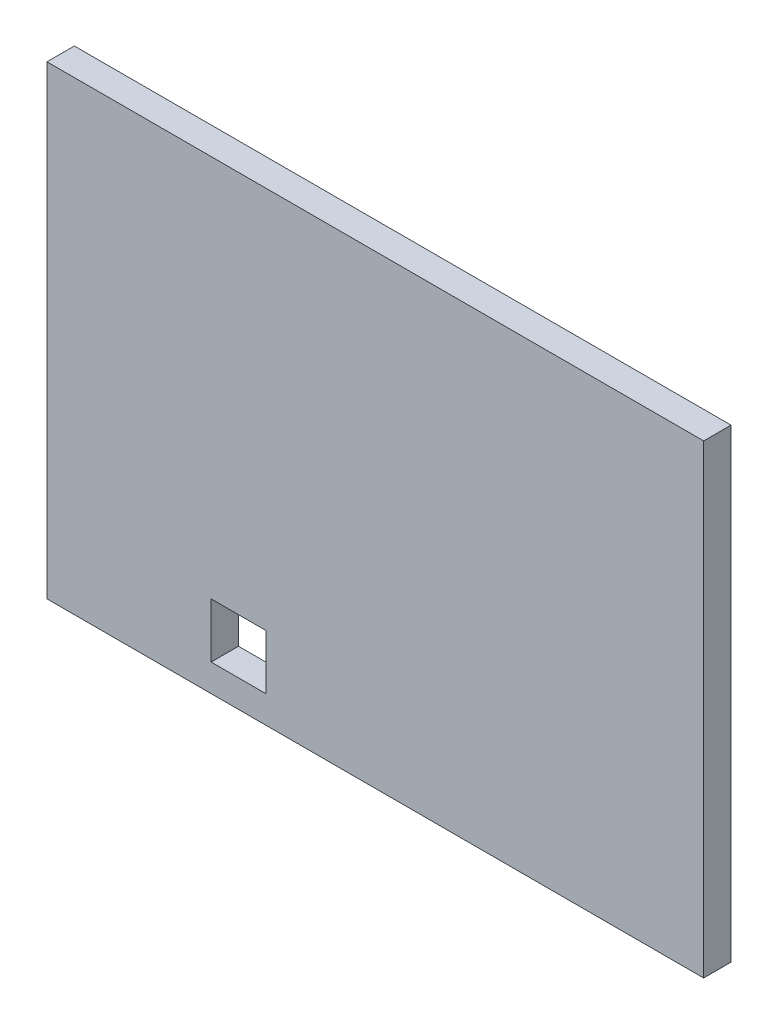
ISO-10303-21;
HEADER;
FILE_DESCRIPTION(('STEP AP214'),'2;1');
FILE_NAME('part.step','',(''),(''),'','','');
FILE_SCHEMA(('AUTOMOTIVE_DESIGN { 1 0 10303 214 1 1 1 1 }'));
ENDSEC;
DATA;
#1=APPLICATION_CONTEXT('core data for automotive mechanical design processes');
#2=APPLICATION_PROTOCOL_DEFINITION('international standard','automotive_design',2000,#1);
#3=PRODUCT_CONTEXT('',#1,'mechanical');
#4=PRODUCT('Part','Part','',(#3));
#5=PRODUCT_RELATED_PRODUCT_CATEGORY('part','',(#4));
#6=PRODUCT_DEFINITION_FORMATION('','',#4);
#7=PRODUCT_DEFINITION_CONTEXT('part definition',#1,'design');
#8=PRODUCT_DEFINITION('design','',#6,#7);
#9=PRODUCT_DEFINITION_SHAPE('','',#8);
#10=(LENGTH_UNIT() NAMED_UNIT(*) SI_UNIT(.MILLI.,.METRE.));
#11=(NAMED_UNIT(*) PLANE_ANGLE_UNIT() SI_UNIT($,.RADIAN.));
#12=(NAMED_UNIT(*) SI_UNIT($,.STERADIAN.) SOLID_ANGLE_UNIT());
#13=UNCERTAINTY_MEASURE_WITH_UNIT(LENGTH_MEASURE(1.E-05),#10,'distance_accuracy_value','');
#14=(GEOMETRIC_REPRESENTATION_CONTEXT(3) GLOBAL_UNCERTAINTY_ASSIGNED_CONTEXT((#13)) GLOBAL_UNIT_ASSIGNED_CONTEXT((#10,
#11,#12)) REPRESENTATION_CONTEXT('',''));
#15=CARTESIAN_POINT('',(0.,0.,0.));
#16=DIRECTION('',(0.,0.,1.));
#17=DIRECTION('',(1.,0.,0.));
#18=AXIS2_PLACEMENT_3D('',#15,#16,#17);
#19=CARTESIAN_POINT('',(-60.,-42.5,5.));
#20=DIRECTION('',(1.,0.,0.));
#21=DIRECTION('',(0.,0.,-1.));
#22=AXIS2_PLACEMENT_3D('',#19,#20,#21);
#23=PLANE('',#22);
#24=DIRECTION('',(0.,-1.,0.));
#25=VECTOR('',#24,1.);
#26=CARTESIAN_POINT('',(-60.,-42.5,0.));
#27=LINE('',#26,#25);
#28=CARTESIAN_POINT('',(-60.,42.5,0.));
#29=VERTEX_POINT('',#28);
#30=CARTESIAN_POINT('',(-60.,-42.5,0.));
#31=VERTEX_POINT('',#30);
#32=EDGE_CURVE('E137',#29,#31,#27,.T.);
#33=ORIENTED_EDGE('',*,*,#32,.T.);
#34=DIRECTION('',(0.,0.,-1.));
#35=VECTOR('',#34,1.);
#36=CARTESIAN_POINT('',(-60.,-42.5,5.));
#37=LINE('',#36,#35);
#38=CARTESIAN_POINT('',(-60.,-42.5,5.));
#39=VERTEX_POINT('',#38);
#40=EDGE_CURVE('E166',#39,#31,#37,.T.);
#41=ORIENTED_EDGE('',*,*,#40,.F.);
#42=DIRECTION('',(0.,-1.,0.));
#43=VECTOR('',#42,1.);
#44=CARTESIAN_POINT('',(-60.,-42.5,5.));
#45=LINE('',#44,#43);
#46=CARTESIAN_POINT('',(-60.,42.5,5.));
#47=VERTEX_POINT('',#46);
#48=EDGE_CURVE('E140',#47,#39,#45,.T.);
#49=ORIENTED_EDGE('',*,*,#48,.F.);
#50=DIRECTION('',(0.,0.,-1.));
#51=VECTOR('',#50,1.);
#52=CARTESIAN_POINT('',(-60.,42.5,5.));
#53=LINE('',#52,#51);
#54=EDGE_CURVE('E150',#47,#29,#53,.T.);
#55=ORIENTED_EDGE('',*,*,#54,.T.);
#56=EDGE_LOOP('',(#33,#41,#49,#55));
#57=FACE_BOUND('',#56,.T.);
#58=ADVANCED_FACE('F47',(#57),#23,.F.);
#59=CARTESIAN_POINT('',(60.,-42.5,5.));
#60=DIRECTION('',(0.,1.,0.));
#61=DIRECTION('',(-1.,0.,0.));
#62=AXIS2_PLACEMENT_3D('',#59,#60,#61);
#63=PLANE('',#62);
#64=DIRECTION('',(1.,0.,0.));
#65=VECTOR('',#64,1.);
#66=CARTESIAN_POINT('',(60.,-42.5,0.));
#67=LINE('',#66,#65);
#68=CARTESIAN_POINT('',(60.,-42.5,0.));
#69=VERTEX_POINT('',#68);
#70=EDGE_CURVE('E153',#31,#69,#67,.T.);
#71=ORIENTED_EDGE('',*,*,#70,.T.);
#72=DIRECTION('',(0.,0.,-1.));
#73=VECTOR('',#72,1.);
#74=CARTESIAN_POINT('',(60.,-42.5,5.));
#75=LINE('',#74,#73);
#76=CARTESIAN_POINT('',(60.,-42.5,5.));
#77=VERTEX_POINT('',#76);
#78=EDGE_CURVE('E163',#77,#69,#75,.T.);
#79=ORIENTED_EDGE('',*,*,#78,.F.);
#80=DIRECTION('',(1.,0.,0.));
#81=VECTOR('',#80,1.);
#82=CARTESIAN_POINT('',(60.,-42.5,5.));
#83=LINE('',#82,#81);
#84=EDGE_CURVE('E143',#39,#77,#83,.T.);
#85=ORIENTED_EDGE('',*,*,#84,.F.);
#86=ORIENTED_EDGE('',*,*,#40,.T.);
#87=EDGE_LOOP('',(#71,#79,#85,#86));
#88=FACE_BOUND('',#87,.T.);
#89=ADVANCED_FACE('F191',(#88),#63,.F.);
#90=CARTESIAN_POINT('',(60.,-42.5,5.));
#91=DIRECTION('',(-1.,0.,0.));
#92=DIRECTION('',(0.,0.,1.));
#93=AXIS2_PLACEMENT_3D('',#90,#91,#92);
#94=PLANE('',#93);
#95=DIRECTION('',(0.,1.,0.));
#96=VECTOR('',#95,1.);
#97=CARTESIAN_POINT('',(60.,-42.5,0.));
#98=LINE('',#97,#96);
#99=CARTESIAN_POINT('',(60.,42.5,0.));
#100=VERTEX_POINT('',#99);
#101=EDGE_CURVE('E155',#69,#100,#98,.T.);
#102=ORIENTED_EDGE('',*,*,#101,.T.);
#103=DIRECTION('',(0.,0.,-1.));
#104=VECTOR('',#103,1.);
#105=CARTESIAN_POINT('',(60.,42.5,5.));
#106=LINE('',#105,#104);
#107=CARTESIAN_POINT('',(60.,42.5,5.));
#108=VERTEX_POINT('',#107);
#109=EDGE_CURVE('E160',#108,#100,#106,.T.);
#110=ORIENTED_EDGE('',*,*,#109,.F.);
#111=DIRECTION('',(0.,1.,0.));
#112=VECTOR('',#111,1.);
#113=CARTESIAN_POINT('',(60.,-42.5,5.));
#114=LINE('',#113,#112);
#115=EDGE_CURVE('E146',#77,#108,#114,.T.);
#116=ORIENTED_EDGE('',*,*,#115,.F.);
#117=ORIENTED_EDGE('',*,*,#78,.T.);
#118=EDGE_LOOP('',(#102,#110,#116,#117));
#119=FACE_BOUND('',#118,.T.);
#120=ADVANCED_FACE('F196',(#119),#94,.F.);
#121=CARTESIAN_POINT('',(60.,42.5,5.));
#122=DIRECTION('',(0.,-1.,0.));
#123=DIRECTION('',(1.,0.,0.));
#124=AXIS2_PLACEMENT_3D('',#121,#122,#123);
#125=PLANE('',#124);
#126=DIRECTION('',(-1.,0.,0.));
#127=VECTOR('',#126,1.);
#128=CARTESIAN_POINT('',(60.,42.5,0.));
#129=LINE('',#128,#127);
#130=EDGE_CURVE('E144',#100,#29,#129,.T.);
#131=ORIENTED_EDGE('',*,*,#130,.T.);
#132=ORIENTED_EDGE('',*,*,#54,.F.);
#133=DIRECTION('',(-1.,0.,0.));
#134=VECTOR('',#133,1.);
#135=CARTESIAN_POINT('',(60.,42.5,5.));
#136=LINE('',#135,#134);
#137=EDGE_CURVE('E148',#108,#47,#136,.T.);
#138=ORIENTED_EDGE('',*,*,#137,.F.);
#139=ORIENTED_EDGE('',*,*,#109,.T.);
#140=EDGE_LOOP('',(#131,#132,#138,#139));
#141=FACE_BOUND('',#140,.T.);
#142=ADVANCED_FACE('F209',(#141),#125,.F.);
#143=CARTESIAN_POINT('',(0.,0.,5.));
#144=DIRECTION('',(0.,0.,1.));
#145=DIRECTION('',(1.,0.,0.));
#146=AXIS2_PLACEMENT_3D('',#143,#144,#145);
#147=PLANE('',#146);
#148=DIRECTION('',(0.,-1.,0.));
#149=VECTOR('',#148,1.);
#150=CARTESIAN_POINT('',(-30.,-27.5,5.));
#151=LINE('',#150,#149);
#152=CARTESIAN_POINT('',(-30.,-27.5,5.));
#153=VERTEX_POINT('',#152);
#154=CARTESIAN_POINT('',(-30.,-37.5,5.));
#155=VERTEX_POINT('',#154);
#156=EDGE_CURVE('E61',#153,#155,#151,.T.);
#157=ORIENTED_EDGE('',*,*,#156,.F.);
#158=DIRECTION('',(1.,0.,0.));
#159=VECTOR('',#158,1.);
#160=CARTESIAN_POINT('',(-30.,-27.5,5.));
#161=LINE('',#160,#159);
#162=CARTESIAN_POINT('',(-20.,-27.5,5.));
#163=VERTEX_POINT('',#162);
#164=EDGE_CURVE('E130',#153,#163,#161,.T.);
#165=ORIENTED_EDGE('',*,*,#164,.T.);
#166=DIRECTION('',(0.,-1.,0.));
#167=VECTOR('',#166,1.);
#168=CARTESIAN_POINT('',(-20.,-27.5,5.));
#169=LINE('',#168,#167);
#170=CARTESIAN_POINT('',(-20.,-37.5,5.));
#171=VERTEX_POINT('',#170);
#172=EDGE_CURVE('E114',#163,#171,#169,.T.);
#173=ORIENTED_EDGE('',*,*,#172,.T.);
#174=DIRECTION('',(1.,0.,0.));
#175=VECTOR('',#174,1.);
#176=CARTESIAN_POINT('',(-30.,-37.5,5.));
#177=LINE('',#176,#175);
#178=EDGE_CURVE('E123',#155,#171,#177,.T.);
#179=ORIENTED_EDGE('',*,*,#178,.F.);
#180=EDGE_LOOP('',(#157,#165,#173,#179));
#181=FACE_BOUND('',#180,.T.);
#182=ORIENTED_EDGE('',*,*,#48,.T.);
#183=ORIENTED_EDGE('',*,*,#84,.T.);
#184=ORIENTED_EDGE('',*,*,#115,.T.);
#185=ORIENTED_EDGE('',*,*,#137,.T.);
#186=EDGE_LOOP('',(#182,#183,#184,#185));
#187=FACE_BOUND('',#186,.T.);
#188=ADVANCED_FACE('F127',(#181,#187),#147,.T.);
#189=CARTESIAN_POINT('',(0.,0.,0.));
#190=DIRECTION('',(0.,0.,1.));
#191=DIRECTION('',(1.,0.,0.));
#192=AXIS2_PLACEMENT_3D('',#189,#190,#191);
#193=PLANE('',#192);
#194=DIRECTION('',(1.,0.,0.));
#195=VECTOR('',#194,1.);
#196=CARTESIAN_POINT('',(0.,-27.5,0.));
#197=LINE('',#196,#195);
#198=CARTESIAN_POINT('',(-30.,-27.5,0.));
#199=VERTEX_POINT('',#198);
#200=CARTESIAN_POINT('',(-20.,-27.5,0.));
#201=VERTEX_POINT('',#200);
#202=EDGE_CURVE('E54',#199,#201,#197,.T.);
#203=ORIENTED_EDGE('',*,*,#202,.F.);
#204=DIRECTION('',(0.,-1.,0.));
#205=VECTOR('',#204,1.);
#206=CARTESIAN_POINT('',(-30.,0.,0.));
#207=LINE('',#206,#205);
#208=CARTESIAN_POINT('',(-30.,-37.5,0.));
#209=VERTEX_POINT('',#208);
#210=EDGE_CURVE('E11',#199,#209,#207,.T.);
#211=ORIENTED_EDGE('',*,*,#210,.T.);
#212=DIRECTION('',(1.,0.,0.));
#213=VECTOR('',#212,1.);
#214=CARTESIAN_POINT('',(0.,-37.5,0.));
#215=LINE('',#214,#213);
#216=CARTESIAN_POINT('',(-20.,-37.5,0.));
#217=VERTEX_POINT('',#216);
#218=EDGE_CURVE('E169',#209,#217,#215,.T.);
#219=ORIENTED_EDGE('',*,*,#218,.T.);
#220=DIRECTION('',(0.,-1.,0.));
#221=VECTOR('',#220,1.);
#222=CARTESIAN_POINT('',(-20.,0.,0.));
#223=LINE('',#222,#221);
#224=EDGE_CURVE('E117',#201,#217,#223,.T.);
#225=ORIENTED_EDGE('',*,*,#224,.F.);
#226=EDGE_LOOP('',(#203,#211,#219,#225));
#227=FACE_BOUND('',#226,.T.);
#228=ORIENTED_EDGE('',*,*,#32,.F.);
#229=ORIENTED_EDGE('',*,*,#130,.F.);
#230=ORIENTED_EDGE('',*,*,#101,.F.);
#231=ORIENTED_EDGE('',*,*,#70,.F.);
#232=EDGE_LOOP('',(#228,#229,#230,#231));
#233=FACE_BOUND('',#232,.T.);
#234=ADVANCED_FACE('F176',(#227,#233),#193,.F.);
#235=CARTESIAN_POINT('',(-30.,-27.5,-5.));
#236=DIRECTION('',(-1.,0.,0.));
#237=DIRECTION('',(0.,-1.,0.));
#238=AXIS2_PLACEMENT_3D('',#235,#236,#237);
#239=PLANE('',#238);
#240=DIRECTION('',(0.,0.,1.));
#241=VECTOR('',#240,1.);
#242=CARTESIAN_POINT('',(-30.,-27.5,-5.));
#243=LINE('',#242,#241);
#244=EDGE_CURVE('E135',#199,#153,#243,.T.);
#245=ORIENTED_EDGE('',*,*,#244,.T.);
#246=ORIENTED_EDGE('',*,*,#156,.T.);
#247=DIRECTION('',(0.,0.,1.));
#248=VECTOR('',#247,1.);
#249=CARTESIAN_POINT('',(-30.,-37.5,-5.));
#250=LINE('',#249,#248);
#251=EDGE_CURVE('E120',#209,#155,#250,.T.);
#252=ORIENTED_EDGE('',*,*,#251,.F.);
#253=ORIENTED_EDGE('',*,*,#210,.F.);
#254=EDGE_LOOP('',(#245,#246,#252,#253));
#255=FACE_BOUND('',#254,.T.);
#256=ADVANCED_FACE('F178',(#255),#239,.F.);
#257=CARTESIAN_POINT('',(-30.,-27.5,-5.));
#258=DIRECTION('',(0.,-1.,0.));
#259=DIRECTION('',(0.,0.,-1.));
#260=AXIS2_PLACEMENT_3D('',#257,#258,#259);
#261=PLANE('',#260);
#262=ORIENTED_EDGE('',*,*,#202,.T.);
#263=DIRECTION('',(0.,0.,1.));
#264=VECTOR('',#263,1.);
#265=CARTESIAN_POINT('',(-20.,-27.5,-5.));
#266=LINE('',#265,#264);
#267=EDGE_CURVE('E119',#201,#163,#266,.T.);
#268=ORIENTED_EDGE('',*,*,#267,.T.);
#269=ORIENTED_EDGE('',*,*,#164,.F.);
#270=ORIENTED_EDGE('',*,*,#244,.F.);
#271=EDGE_LOOP('',(#262,#268,#269,#270));
#272=FACE_BOUND('',#271,.T.);
#273=ADVANCED_FACE('F174',(#272),#261,.T.);
#274=CARTESIAN_POINT('',(-20.,-27.5,-5.));
#275=DIRECTION('',(-1.,0.,0.));
#276=DIRECTION('',(0.,-1.,0.));
#277=AXIS2_PLACEMENT_3D('',#274,#275,#276);
#278=PLANE('',#277);
#279=ORIENTED_EDGE('',*,*,#224,.T.);
#280=DIRECTION('',(0.,0.,1.));
#281=VECTOR('',#280,1.);
#282=CARTESIAN_POINT('',(-20.,-37.5,-5.));
#283=LINE('',#282,#281);
#284=EDGE_CURVE('E69',#217,#171,#283,.T.);
#285=ORIENTED_EDGE('',*,*,#284,.T.);
#286=ORIENTED_EDGE('',*,*,#172,.F.);
#287=ORIENTED_EDGE('',*,*,#267,.F.);
#288=EDGE_LOOP('',(#279,#285,#286,#287));
#289=FACE_BOUND('',#288,.T.);
#290=ADVANCED_FACE('F111',(#289),#278,.T.);
#291=CARTESIAN_POINT('',(-30.,-37.5,-5.));
#292=DIRECTION('',(0.,-1.,0.));
#293=DIRECTION('',(0.,0.,-1.));
#294=AXIS2_PLACEMENT_3D('',#291,#292,#293);
#295=PLANE('',#294);
#296=ORIENTED_EDGE('',*,*,#251,.T.);
#297=ORIENTED_EDGE('',*,*,#178,.T.);
#298=ORIENTED_EDGE('',*,*,#284,.F.);
#299=ORIENTED_EDGE('',*,*,#218,.F.);
#300=EDGE_LOOP('',(#296,#297,#298,#299));
#301=FACE_BOUND('',#300,.T.);
#302=ADVANCED_FACE('F124',(#301),#295,.F.);
#303=CLOSED_SHELL('',(#58,#89,#120,#142,#188,#234,#256,#273,#290,#302));
#304=MANIFOLD_SOLID_BREP('B2',#303);
#305=ADVANCED_BREP_SHAPE_REPRESENTATION('',(#18,#304),#14);
#306=SHAPE_DEFINITION_REPRESENTATION(#9,#305);
ENDSEC;
END-ISO-10303-21;
